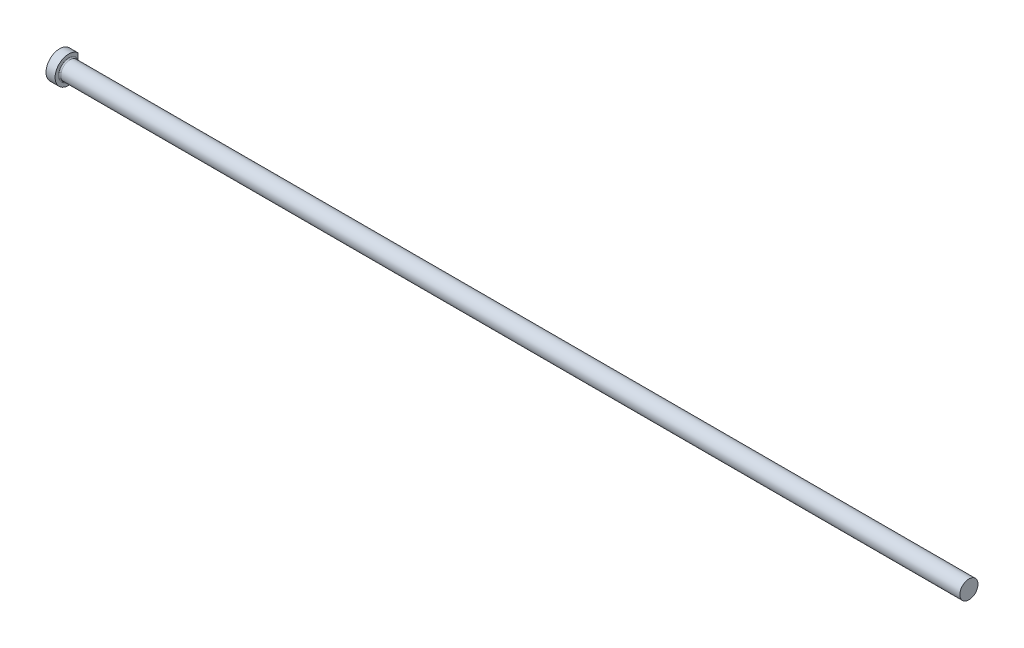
ISO-10303-21;
HEADER;
FILE_DESCRIPTION(('STEP AP214'),'2;1');
FILE_NAME('part.step','',(''),(''),'','','');
FILE_SCHEMA(('AUTOMOTIVE_DESIGN { 1 0 10303 214 1 1 1 1 }'));
ENDSEC;
DATA;
#1=APPLICATION_CONTEXT('core data for automotive mechanical design processes');
#2=APPLICATION_PROTOCOL_DEFINITION('international standard','automotive_design',2000,#1);
#3=PRODUCT_CONTEXT('',#1,'mechanical');
#4=PRODUCT('Part','Part','',(#3));
#5=PRODUCT_RELATED_PRODUCT_CATEGORY('part','',(#4));
#6=PRODUCT_DEFINITION_FORMATION('','',#4);
#7=PRODUCT_DEFINITION_CONTEXT('part definition',#1,'design');
#8=PRODUCT_DEFINITION('design','',#6,#7);
#9=PRODUCT_DEFINITION_SHAPE('','',#8);
#10=(LENGTH_UNIT() NAMED_UNIT(*) SI_UNIT(.MILLI.,.METRE.));
#11=(NAMED_UNIT(*) PLANE_ANGLE_UNIT() SI_UNIT($,.RADIAN.));
#12=(NAMED_UNIT(*) SI_UNIT($,.STERADIAN.) SOLID_ANGLE_UNIT());
#13=UNCERTAINTY_MEASURE_WITH_UNIT(LENGTH_MEASURE(1.E-05),#10,'distance_accuracy_value','');
#14=(GEOMETRIC_REPRESENTATION_CONTEXT(3) GLOBAL_UNCERTAINTY_ASSIGNED_CONTEXT((#13)) GLOBAL_UNIT_ASSIGNED_CONTEXT((#10,
#11,#12)) REPRESENTATION_CONTEXT('',''));
#15=CARTESIAN_POINT('',(0.,0.,0.));
#16=DIRECTION('',(0.,0.,1.));
#17=DIRECTION('',(1.,0.,0.));
#18=AXIS2_PLACEMENT_3D('',#15,#16,#17);
#19=CARTESIAN_POINT('',(0.,0.,0.));
#20=DIRECTION('',(1.,0.,0.));
#21=DIRECTION('',(0.,1.,0.));
#22=AXIS2_PLACEMENT_3D('',#19,#20,#21);
#23=PLANE('',#22);
#24=DIRECTION('',(0.,1.,0.));
#25=VECTOR('',#24,1.);
#26=CARTESIAN_POINT('',(0.,0.,-6.52779999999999));
#27=LINE('',#26,#25);
#28=CARTESIAN_POINT('',(0.,-6.93638610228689,-6.52779999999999));
#29=VERTEX_POINT('',#28);
#30=CARTESIAN_POINT('',(0.,6.93638610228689,-6.52779999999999));
#31=VERTEX_POINT('',#30);
#32=EDGE_CURVE('E49',#29,#31,#27,.T.);
#33=ORIENTED_EDGE('',*,*,#32,.F.);
#34=CARTESIAN_POINT('',(0.,0.,0.));
#35=DIRECTION('',(-1.,0.,0.));
#36=DIRECTION('',(0.,-1.,0.));
#37=AXIS2_PLACEMENT_3D('',#34,#35,#36);
#38=CIRCLE('',#37,9.52499999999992);
#39=EDGE_CURVE('E43',#29,#31,#38,.T.);
#40=ORIENTED_EDGE('',*,*,#39,.T.);
#41=EDGE_LOOP('',(#33,#40));
#42=FACE_BOUND('',#41,.T.);
#43=ADVANCED_FACE('F32',(#42),#23,.F.);
#44=CARTESIAN_POINT('',(635.,0.,0.));
#45=DIRECTION('',(-1.,0.,0.));
#46=DIRECTION('',(0.,-1.,0.));
#47=AXIS2_PLACEMENT_3D('',#44,#45,#46);
#48=CYLINDRICAL_SURFACE('',#47,9.52499999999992);
#49=DIRECTION('',(-1.,0.,0.));
#50=VECTOR('',#49,1.);
#51=CARTESIAN_POINT('',(635.,-6.93638610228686,-6.52779999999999));
#52=LINE('',#51,#50);
#53=CARTESIAN_POINT('',(6.34999999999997,-6.93638610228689,-6.52779999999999));
#54=VERTEX_POINT('',#53);
#55=EDGE_CURVE('E87',#54,#29,#52,.T.);
#56=ORIENTED_EDGE('',*,*,#55,.F.);
#57=CARTESIAN_POINT('',(6.34999999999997,0.,0.));
#58=DIRECTION('',(-1.,0.,0.));
#59=DIRECTION('',(0.,-1.,0.));
#60=AXIS2_PLACEMENT_3D('',#57,#58,#59);
#61=CIRCLE('',#60,9.52499999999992);
#62=CARTESIAN_POINT('',(6.34999999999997,6.93638610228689,-6.52779999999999));
#63=VERTEX_POINT('',#62);
#64=EDGE_CURVE('E75',#54,#63,#61,.T.);
#65=ORIENTED_EDGE('',*,*,#64,.T.);
#66=DIRECTION('',(-1.,0.,0.));
#67=VECTOR('',#66,1.);
#68=CARTESIAN_POINT('',(635.,6.93638610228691,-6.52779999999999));
#69=LINE('',#68,#67);
#70=EDGE_CURVE('E56',#31,#63,#69,.F.);
#71=ORIENTED_EDGE('',*,*,#70,.F.);
#72=ORIENTED_EDGE('',*,*,#39,.F.);
#73=EDGE_LOOP('',(#56,#65,#71,#72));
#74=FACE_BOUND('',#73,.T.);
#75=ADVANCED_FACE('F97',(#74),#48,.T.);
#76=CARTESIAN_POINT('',(6.35,9.52499999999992,0.));
#77=DIRECTION('',(-1.,0.,0.));
#78=DIRECTION('',(0.,-1.,0.));
#79=AXIS2_PLACEMENT_3D('',#76,#77,#78);
#80=PLANE('',#79);
#81=DIRECTION('',(0.,-1.,0.));
#82=VECTOR('',#81,1.);
#83=CARTESIAN_POINT('',(6.35,9.52499999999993,-6.52779999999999));
#84=LINE('',#83,#82);
#85=CARTESIAN_POINT('',(6.34999999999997,2.88622693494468,-6.52779999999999));
#86=VERTEX_POINT('',#85);
#87=EDGE_CURVE('E84',#63,#86,#84,.T.);
#88=ORIENTED_EDGE('',*,*,#87,.F.);
#89=ORIENTED_EDGE('',*,*,#64,.F.);
#90=CARTESIAN_POINT('',(6.35,-2.88622693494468,-6.52779999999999));
#91=VERTEX_POINT('',#90);
#92=EDGE_CURVE('E80',#91,#54,#84,.T.);
#93=ORIENTED_EDGE('',*,*,#92,.F.);
#94=CARTESIAN_POINT('',(6.34999999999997,0.,0.));
#95=DIRECTION('',(-1.,0.,0.));
#96=DIRECTION('',(0.,-1.,0.));
#97=AXIS2_PLACEMENT_3D('',#94,#95,#96);
#98=CIRCLE('',#97,7.1374);
#99=EDGE_CURVE('E70',#91,#86,#98,.T.);
#100=ORIENTED_EDGE('',*,*,#99,.T.);
#101=EDGE_LOOP('',(#88,#89,#93,#100));
#102=FACE_BOUND('',#101,.T.);
#103=ADVANCED_FACE('F81',(#102),#80,.F.);
#104=CARTESIAN_POINT('',(7.1374,0.,0.));
#105=DIRECTION('',(-1.,0.,0.));
#106=DIRECTION('',(0.,-1.,0.));
#107=AXIS2_PLACEMENT_3D('',#104,#105,#106);
#108=TOROIDAL_SURFACE('',#107,7.1374,0.7874);
#109=CARTESIAN_POINT('',(7.13739999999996,0.,0.));
#110=DIRECTION('',(-1.,0.,0.));
#111=DIRECTION('',(0.,-1.,0.));
#112=AXIS2_PLACEMENT_3D('',#109,#110,#111);
#113=CIRCLE('',#112,6.35);
#114=CARTESIAN_POINT('',(7.13739999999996,-6.35,0.));
#115=VERTEX_POINT('',#114);
#116=EDGE_CURVE('E76',#115,#115,#113,.T.);
#117=ORIENTED_EDGE('',*,*,#116,.T.);
#118=EDGE_LOOP('',(#117));
#119=FACE_BOUND('',#118,.T.);
#120=CARTESIAN_POINT('',(6.63901601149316,0.,-6.52779999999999));
#121=CARTESIAN_POINT('',(6.63901644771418,-0.0657930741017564,-6.52779999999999));
#122=CARTESIAN_POINT('',(6.63779028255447,-0.131585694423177,-6.52779999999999));
#123=CARTESIAN_POINT('',(6.63299087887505,-0.263087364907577,-6.52779999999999));
#124=CARTESIAN_POINT('',(6.6294174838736,-0.328796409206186,-6.52779999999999));
#125=CARTESIAN_POINT('',(6.61555674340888,-0.52576216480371,-6.52779999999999));
#126=CARTESIAN_POINT('',(6.60212925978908,-0.656794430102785,-6.52779999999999));
#127=CARTESIAN_POINT('',(6.57011296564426,-0.919062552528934,-6.52779999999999));
#128=CARTESIAN_POINT('',(6.55148997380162,-1.05029382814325,-6.52779999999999));
#129=CARTESIAN_POINT('',(6.5126303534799,-1.31258160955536,-6.52779999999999));
#130=CARTESIAN_POINT('',(6.4923928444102,-1.44363797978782,-6.52779999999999));
#131=CARTESIAN_POINT('',(6.45671462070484,-1.68300428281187,-6.52779999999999));
#132=CARTESIAN_POINT('',(6.44105431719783,-1.79128046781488,-6.52779999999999));
#133=CARTESIAN_POINT('',(6.4121649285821,-2.00818400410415,-6.52779999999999));
#134=CARTESIAN_POINT('',(6.39893618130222,-2.11681140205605,-6.52779999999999));
#135=CARTESIAN_POINT('',(6.37640984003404,-2.33430472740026,-6.52779999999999));
#136=CARTESIAN_POINT('',(6.36710572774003,-2.443169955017,-6.52779999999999));
#137=CARTESIAN_POINT('',(6.35397832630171,-2.66121869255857,-6.52779999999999));
#138=CARTESIAN_POINT('',(6.35015246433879,-2.77040202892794,-6.52779999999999));
#139=CARTESIAN_POINT('',(6.34991766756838,-2.94374292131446,-6.52779999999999));
#140=CARTESIAN_POINT('',(6.35110031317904,-3.00789610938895,-6.52779999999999));
#141=CARTESIAN_POINT('',(6.35647225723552,-3.13610972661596,-6.52779999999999));
#142=CARTESIAN_POINT('',(6.3606626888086,-3.20017011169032,-6.52779999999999));
#143=CARTESIAN_POINT('',(6.37259665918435,-3.32794004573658,-6.52779999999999));
#144=CARTESIAN_POINT('',(6.38033850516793,-3.39164974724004,-6.52779999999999));
#145=CARTESIAN_POINT('',(6.40004602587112,-3.51839481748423,-6.52779999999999));
#146=CARTESIAN_POINT('',(6.41200949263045,-3.58143052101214,-6.52779999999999));
#147=CARTESIAN_POINT('',(6.44333242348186,-3.71638651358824,-6.52779999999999));
#148=CARTESIAN_POINT('',(6.46357074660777,-3.78810901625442,-6.52779999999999));
#149=CARTESIAN_POINT('',(6.51261769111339,-3.92863037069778,-6.52779999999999));
#150=CARTESIAN_POINT('',(6.54141681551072,-3.99743236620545,-6.52779999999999));
#151=CARTESIAN_POINT('',(6.59871994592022,-4.1078028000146,-6.52779999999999));
#152=CARTESIAN_POINT('',(6.62423136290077,-4.15091044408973,-6.52779999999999));
#153=CARTESIAN_POINT('',(6.68110480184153,-4.23312392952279,-6.52779999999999));
#154=CARTESIAN_POINT('',(6.71245691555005,-4.2722363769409,-6.52779999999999));
#155=CARTESIAN_POINT('',(6.7709220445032,-4.33280276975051,-6.52779999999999));
#156=CARTESIAN_POINT('',(6.79627456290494,-4.35594498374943,-6.52779999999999));
#157=CARTESIAN_POINT('',(6.85023309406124,-4.39809153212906,-6.52779999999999));
#158=CARTESIAN_POINT('',(6.87883426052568,-4.41710191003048,-6.52779999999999));
#159=CARTESIAN_POINT('',(6.9330870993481,-4.4463787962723,-6.52779999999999));
#160=CARTESIAN_POINT('',(6.95820262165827,-4.45763114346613,-6.52779999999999));
#161=CARTESIAN_POINT('',(7.00995920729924,-4.47582045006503,-6.52779999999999));
#162=CARTESIAN_POINT('',(7.03659903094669,-4.4827608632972,-6.52779999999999));
#163=CARTESIAN_POINT('',(7.09085505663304,-4.4917690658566,-6.52779999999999));
#164=CARTESIAN_POINT('',(7.11847577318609,-4.49381020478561,-6.52779999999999));
#165=CARTESIAN_POINT('',(7.17361672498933,-4.49274192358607,-6.52779999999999));
#166=CARTESIAN_POINT('',(7.2011369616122,-4.489632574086,-6.52779999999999));
#167=CARTESIAN_POINT('',(7.25292339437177,-4.47902460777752,-6.52779999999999));
#168=CARTESIAN_POINT('',(7.27727050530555,-4.47191015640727,-6.52779999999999));
#169=CARTESIAN_POINT('',(7.32460612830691,-4.45410498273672,-6.52779999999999));
#170=CARTESIAN_POINT('',(7.34759413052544,-4.44341292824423,-6.52779999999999));
#171=CARTESIAN_POINT('',(7.40176610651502,-4.41362274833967,-6.52779999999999));
#172=CARTESIAN_POINT('',(7.43205576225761,-4.39290025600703,-6.52779999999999));
#173=CARTESIAN_POINT('',(7.48894558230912,-4.34689823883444,-6.52779999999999));
#174=CARTESIAN_POINT('',(7.51553684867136,-4.32160804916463,-6.52779999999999));
#175=CARTESIAN_POINT('',(7.57887879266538,-4.25296468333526,-6.52779999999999));
#176=CARTESIAN_POINT('',(7.61314947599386,-4.20733933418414,-6.52779999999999));
#177=CARTESIAN_POINT('',(7.67447290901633,-4.11151073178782,-6.52779999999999));
#178=CARTESIAN_POINT('',(7.70150829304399,-4.06129684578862,-6.52779999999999));
#179=CARTESIAN_POINT('',(7.74730597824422,-3.9629857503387,-6.52779999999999));
#180=CARTESIAN_POINT('',(7.7666075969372,-3.9151344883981,-6.52779999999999));
#181=CARTESIAN_POINT('',(7.80105869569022,-3.81793882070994,-6.52779999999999));
#182=CARTESIAN_POINT('',(7.81620462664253,-3.76859317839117,-6.52779999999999));
#183=CARTESIAN_POINT('',(7.84295827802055,-3.66892230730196,-6.52779999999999));
#184=CARTESIAN_POINT('',(7.85456297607,-3.61859628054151,-6.52779999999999));
#185=CARTESIAN_POINT('',(7.87471467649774,-3.51736621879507,-6.52779999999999));
#186=CARTESIAN_POINT('',(7.88326278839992,-3.46646240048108,-6.52779999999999));
#187=CARTESIAN_POINT('',(7.90067504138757,-3.34343462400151,-6.52779999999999));
#188=CARTESIAN_POINT('',(7.90824458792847,-3.27112827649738,-6.52779999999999));
#189=CARTESIAN_POINT('',(7.91908335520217,-3.12618302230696,-6.52779999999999));
#190=CARTESIAN_POINT('',(7.92235046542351,-3.05354396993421,-6.52779999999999));
#191=CARTESIAN_POINT('',(7.92683516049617,-2.83528850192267,-6.52779999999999));
#192=CARTESIAN_POINT('',(7.92270858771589,-2.68956605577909,-6.52779999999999));
#193=CARTESIAN_POINT('',(7.90475897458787,-2.39759555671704,-6.52779999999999));
#194=CARTESIAN_POINT('',(7.89085302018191,-2.25135372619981,-6.52779999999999));
#195=CARTESIAN_POINT('',(7.85700674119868,-1.95973428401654,-6.52779999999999));
#196=CARTESIAN_POINT('',(7.83707165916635,-1.8143560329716,-6.52779999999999));
#197=CARTESIAN_POINT('',(7.79223464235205,-1.50712650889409,-6.52779999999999));
#198=CARTESIAN_POINT('',(7.76702473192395,-1.34532401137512,-6.52779999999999));
#199=CARTESIAN_POINT('',(7.7190043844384,-1.0212594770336,-6.52779999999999));
#200=CARTESIAN_POINT('',(7.69619470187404,-0.858997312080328,-6.52779999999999));
#201=CARTESIAN_POINT('',(7.66886659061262,-0.615678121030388,-6.52779999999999));
#202=CARTESIAN_POINT('',(7.66092984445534,-0.535023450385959,-6.52779999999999));
#203=CARTESIAN_POINT('',(7.64805328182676,-0.37348038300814,-6.52779999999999));
#204=CARTESIAN_POINT('',(7.64311299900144,-0.292592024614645,-6.52779999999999));
#205=CARTESIAN_POINT('',(7.63678993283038,-0.130758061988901,-6.52779999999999));
#206=CARTESIAN_POINT('',(7.63540330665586,-0.0498126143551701,-6.52779999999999));
#207=CARTESIAN_POINT('',(7.63634612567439,0.112055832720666,-6.52779999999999));
#208=CARTESIAN_POINT('',(7.63867559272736,0.192978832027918,-6.52779999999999));
#209=CARTESIAN_POINT('',(7.64723816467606,0.363961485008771,-6.52779999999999));
#210=CARTESIAN_POINT('',(7.65389014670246,0.453999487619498,-6.52779999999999));
#211=CARTESIAN_POINT('',(7.67057840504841,0.633758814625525,-6.52779999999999));
#212=CARTESIAN_POINT('',(7.68061512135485,0.723480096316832,-6.52779999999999));
#213=CARTESIAN_POINT('',(7.70296726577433,0.902797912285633,-6.52779999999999));
#214=CARTESIAN_POINT('',(7.71528688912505,0.992393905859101,-6.52779999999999));
#215=CARTESIAN_POINT('',(7.74108017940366,1.17141282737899,-6.52779999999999));
#216=CARTESIAN_POINT('',(7.7545538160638,1.26083575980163,-6.52779999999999));
#217=CARTESIAN_POINT('',(7.79540879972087,1.53076625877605,-6.52779999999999));
#218=CARTESIAN_POINT('',(7.82297275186,1.71124349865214,-6.52779999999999));
#219=CARTESIAN_POINT('',(7.87137102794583,2.07295737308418,-6.52779999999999));
#220=CARTESIAN_POINT('',(7.89221479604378,2.25419257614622,-6.52779999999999));
#221=CARTESIAN_POINT('',(7.91330544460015,2.52729761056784,-6.52779999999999));
#222=CARTESIAN_POINT('',(7.91864029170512,2.61875609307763,-6.52779999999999));
#223=CARTESIAN_POINT('',(7.92484591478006,2.80181357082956,-6.52779999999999));
#224=CARTESIAN_POINT('',(7.92571813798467,2.89341251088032,-6.52779999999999));
#225=CARTESIAN_POINT('',(7.9218085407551,3.07601526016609,-6.52779999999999));
#226=CARTESIAN_POINT('',(7.91705732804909,3.16701960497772,-6.52779999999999));
#227=CARTESIAN_POINT('',(7.90046196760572,3.34834402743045,-6.52779999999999));
#228=CARTESIAN_POINT('',(7.88862552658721,3.4386647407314,-6.52779999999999));
#229=CARTESIAN_POINT('',(7.86136065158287,3.58761682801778,-6.52779999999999));
#230=CARTESIAN_POINT('',(7.84847177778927,3.64670810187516,-6.52779999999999));
#231=CARTESIAN_POINT('',(7.81783228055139,3.76385836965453,-6.52779999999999));
#232=CARTESIAN_POINT('',(7.80006538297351,3.82191320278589,-6.52779999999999));
#233=CARTESIAN_POINT('',(7.75342880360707,3.95051789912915,-6.52779999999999));
#234=CARTESIAN_POINT('',(7.72288303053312,4.0204775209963,-6.52779999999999));
#235=CARTESIAN_POINT('',(7.65003295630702,4.15396303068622,-6.52779999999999));
#236=CARTESIAN_POINT('',(7.60779892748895,4.21752436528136,-6.52779999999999));
#237=CARTESIAN_POINT('',(7.53647698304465,4.29981474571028,-6.52779999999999));
#238=CARTESIAN_POINT('',(7.51332552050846,4.32367553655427,-6.52779999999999));
#239=CARTESIAN_POINT('',(7.46396465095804,4.36807267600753,-6.52779999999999));
#240=CARTESIAN_POINT('',(7.43775463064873,4.38860835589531,-6.52779999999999));
#241=CARTESIAN_POINT('',(7.38196767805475,4.42540217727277,-6.52779999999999));
#242=CARTESIAN_POINT('',(7.35235368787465,4.44160528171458,-6.52779999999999));
#243=CARTESIAN_POINT('',(7.29053705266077,4.46795310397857,-6.52779999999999));
#244=CARTESIAN_POINT('',(7.25833959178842,4.4781096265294,-6.52779999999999));
#245=CARTESIAN_POINT('',(7.19644050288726,4.49040772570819,-6.52779999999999));
#246=CARTESIAN_POINT('',(7.16690212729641,4.49336389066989,-6.52779999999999));
#247=CARTESIAN_POINT('',(7.10782823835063,4.49335569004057,-6.52779999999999));
#248=CARTESIAN_POINT('',(7.07829272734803,4.49039330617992,-6.52779999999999));
#249=CARTESIAN_POINT('',(7.02448918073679,4.47970576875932,-6.52779999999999));
#250=CARTESIAN_POINT('',(7.00006897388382,4.47271712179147,-6.52779999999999));
#251=CARTESIAN_POINT('',(6.95257735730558,4.45513534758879,-6.52779999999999));
#252=CARTESIAN_POINT('',(6.92950628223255,4.44454133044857,-6.52779999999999));
#253=CARTESIAN_POINT('',(6.87533060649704,4.41506598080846,-6.52779999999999));
#254=CARTESIAN_POINT('',(6.84509808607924,4.39458439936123,-6.52779999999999));
#255=CARTESIAN_POINT('',(6.78828531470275,4.34906654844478,-6.52779999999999));
#256=CARTESIAN_POINT('',(6.76171390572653,4.32401958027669,-6.52779999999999));
#257=CARTESIAN_POINT('',(6.69847203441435,4.25607843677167,-6.52779999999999));
#258=CARTESIAN_POINT('',(6.66424587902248,4.21092523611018,-6.52779999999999));
#259=CARTESIAN_POINT('',(6.60294985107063,4.11604206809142,-6.52779999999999));
#260=CARTESIAN_POINT('',(6.57589652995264,4.06630186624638,-6.52779999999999));
#261=CARTESIAN_POINT('',(6.53006910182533,3.96898574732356,-6.52779999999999));
#262=CARTESIAN_POINT('',(6.51074907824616,3.92166150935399,-6.52779999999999));
#263=CARTESIAN_POINT('',(6.47621700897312,3.82551648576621,-6.52779999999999));
#264=CARTESIAN_POINT('',(6.46100844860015,3.77669446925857,-6.52779999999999));
#265=CARTESIAN_POINT('',(6.43409062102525,3.6780471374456,-6.52779999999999));
#266=CARTESIAN_POINT('',(6.42238559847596,3.62822068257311,-6.52779999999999));
#267=CARTESIAN_POINT('',(6.4020085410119,3.52798105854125,-6.52779999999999));
#268=CARTESIAN_POINT('',(6.39333543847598,3.47756810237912,-6.52779999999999));
#269=CARTESIAN_POINT('',(6.37568471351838,3.35629905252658,-6.52779999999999));
#270=CARTESIAN_POINT('',(6.36794990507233,3.28526290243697,-6.52779999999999));
#271=CARTESIAN_POINT('',(6.35669152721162,3.14284702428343,-6.52779999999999));
#272=CARTESIAN_POINT('',(6.35316998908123,3.07146714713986,-6.52779999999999));
#273=CARTESIAN_POINT('',(6.34782697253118,2.85697626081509,-6.52779999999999));
#274=CARTESIAN_POINT('',(6.35125457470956,2.7137376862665,-6.52779999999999));
#275=CARTESIAN_POINT('',(6.36770054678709,2.4268690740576,-6.52779999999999));
#276=CARTESIAN_POINT('',(6.38079014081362,2.28324406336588,-6.52779999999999));
#277=CARTESIAN_POINT('',(6.4130588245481,1.99684822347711,-6.52779999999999));
#278=CARTESIAN_POINT('',(6.43223239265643,1.85407673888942,-6.52779999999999));
#279=CARTESIAN_POINT('',(6.47335763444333,1.56869278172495,-6.52779999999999));
#280=CARTESIAN_POINT('',(6.49531432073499,1.42608107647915,-6.52779999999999));
#281=CARTESIAN_POINT('',(6.53832277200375,1.1406462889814,-6.52779999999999));
#282=CARTESIAN_POINT('',(6.55937409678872,0.997823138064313,-6.52779999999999));
#283=CARTESIAN_POINT('',(6.59596084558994,0.712816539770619,-6.52779999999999));
#284=CARTESIAN_POINT('',(6.6115482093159,0.570640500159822,-6.52779999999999));
#285=CARTESIAN_POINT('',(6.62773323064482,0.356875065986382,-6.52779999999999));
#286=CARTESIAN_POINT('',(6.63192865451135,0.285565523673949,-6.52779999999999));
#287=CARTESIAN_POINT('',(6.63756975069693,0.142837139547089,-6.52779999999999));
#288=CARTESIAN_POINT('',(6.63901553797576,0.0714183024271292,-6.52779999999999));
#289=CARTESIAN_POINT('',(6.63901601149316,0.,-6.52779999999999));
#290=B_SPLINE_CURVE_WITH_KNOTS('',3,(#120,#121,#122,#123,#124,#125,#126,#127,#128,#129,#130,
#131,#132,#133,#134,#135,#136,#137,#138,#139,#140,#141,#142,#143,#144,#145,#146,#147,#148,#149,
#150,#151,#152,#153,#154,#155,#156,#157,#158,#159,#160,#161,#162,#163,#164,#165,#166,#167,#168,
#169,#170,#171,#172,#173,#174,#175,#176,#177,#178,#179,#180,#181,#182,#183,#184,#185,#186,#187,
#188,#189,#190,#191,#192,#193,#194,#195,#196,#197,#198,#199,#200,#201,#202,#203,#204,#205,#206,
#207,#208,#209,#210,#211,#212,#213,#214,#215,#216,#217,#218,#219,#220,#221,#222,#223,#224,#225,
#226,#227,#228,#229,#230,#231,#232,#233,#234,#235,#236,#237,#238,#239,#240,#241,#242,#243,#244,
#245,#246,#247,#248,#249,#250,#251,#252,#253,#254,#255,#256,#257,#258,#259,#260,#261,#262,#263,
#264,#265,#266,#267,#268,#269,#270,#271,#272,#273,#274,#275,#276,#277,#278,#279,#280,#281,#282,
#283,#284,#285,#286,#287,#288,#289),.UNSPECIFIED.,.T.,.F.,(4,2,2,2,2,2,2,2,2,2,2,2,2,2,2,2,2,2,
2,2,2,2,2,2,2,2,2,2,2,2,2,2,2,2,2,2,2,2,2,2,2,2,2,2,2,2,2,2,2,2,2,2,2,2,2,2,2,2,2,2,2,2,2,2,2,2,
2,2,2,2,2,2,2,2,2,2,2,2,2,2,2,2,2,2,4),(0.,0.19736763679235,0.394748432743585,0.789698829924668,
1.18731150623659,1.58514255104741,1.91333986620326,2.24158274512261,2.56927828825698,
2.89681988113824,3.08925583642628,3.281764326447,3.47418115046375,3.66649748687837,
3.8896796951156,4.11261523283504,4.26253512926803,4.41220297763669,4.51487143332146,
4.61738869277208,4.69962137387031,4.78178810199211,4.86440078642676,4.94701233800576,
5.02279347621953,5.09860286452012,5.20808133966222,5.31781881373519,5.48804853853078,
5.65868324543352,5.81324977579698,5.96794790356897,6.12277769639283,6.27755122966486,
6.49548587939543,6.71352739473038,7.15030868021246,7.59083855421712,8.0309864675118,
8.5222790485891,9.01372560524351,9.25681320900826,9.4998629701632,9.74264979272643,
9.98543804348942,10.256202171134,10.5270015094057,10.7983035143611,11.0695984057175,
11.6173198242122,12.1642681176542,12.4390268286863,12.7136964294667,12.9868778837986,
13.2597627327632,13.4410442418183,13.622938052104,13.8512302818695,14.0781787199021,
14.17768001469,14.277201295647,14.3779324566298,14.4784663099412,14.5669532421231,
14.6554105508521,14.7312996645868,14.8072075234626,14.9161418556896,15.0253348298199,
15.1943603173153,15.3637725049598,15.5168971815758,15.6701512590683,15.8235902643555,
15.9769751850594,16.1911781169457,16.4054842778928,16.8347693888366,17.26725101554,
17.6993412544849,18.132221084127,18.5653090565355,18.9941607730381,19.2084120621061,
19.4226543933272),.UNSPECIFIED.);
#291=EDGE_CURVE('E12',#86,#91,#290,.T.);
#292=ORIENTED_EDGE('',*,*,#291,.F.);
#293=ORIENTED_EDGE('',*,*,#99,.F.);
#294=EDGE_LOOP('',(#292,#293));
#295=FACE_BOUND('',#294,.T.);
#296=ADVANCED_FACE('F72',(#119,#295),#108,.F.);
#297=CARTESIAN_POINT('',(635.,0.,0.));
#298=DIRECTION('',(-1.,0.,0.));
#299=DIRECTION('',(0.,-1.,0.));
#300=AXIS2_PLACEMENT_3D('',#297,#298,#299);
#301=CYLINDRICAL_SURFACE('',#300,6.34999999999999);
#302=ORIENTED_EDGE('',*,*,#116,.F.);
#303=EDGE_LOOP('',(#302));
#304=FACE_BOUND('',#303,.T.);
#305=CARTESIAN_POINT('',(635.,0.,0.));
#306=DIRECTION('',(-1.,0.,0.));
#307=DIRECTION('',(0.,-1.,0.));
#308=AXIS2_PLACEMENT_3D('',#305,#306,#307);
#309=CIRCLE('',#308,6.34999999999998);
#310=CARTESIAN_POINT('',(635.,-6.34999999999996,0.));
#311=VERTEX_POINT('',#310);
#312=EDGE_CURVE('E92',#311,#311,#309,.T.);
#313=ORIENTED_EDGE('',*,*,#312,.T.);
#314=EDGE_LOOP('',(#313));
#315=FACE_BOUND('',#314,.T.);
#316=ADVANCED_FACE('F107',(#304,#315),#301,.T.);
#317=CARTESIAN_POINT('',(635.,6.35,0.));
#318=DIRECTION('',(-1.,0.,0.));
#319=DIRECTION('',(0.,-1.,0.));
#320=AXIS2_PLACEMENT_3D('',#317,#318,#319);
#321=PLANE('',#320);
#322=ORIENTED_EDGE('',*,*,#312,.F.);
#323=EDGE_LOOP('',(#322));
#324=FACE_BOUND('',#323,.T.);
#325=ADVANCED_FACE('F111',(#324),#321,.F.);
#326=CARTESIAN_POINT('',(0.,0.,-6.52779999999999));
#327=DIRECTION('',(0.,0.,-1.));
#328=DIRECTION('',(0.,1.,0.));
#329=AXIS2_PLACEMENT_3D('',#326,#327,#328);
#330=PLANE('',#329);
#331=ORIENTED_EDGE('',*,*,#55,.T.);
#332=ORIENTED_EDGE('',*,*,#32,.T.);
#333=ORIENTED_EDGE('',*,*,#70,.T.);
#334=ORIENTED_EDGE('',*,*,#87,.T.);
#335=ORIENTED_EDGE('',*,*,#291,.T.);
#336=ORIENTED_EDGE('',*,*,#92,.T.);
#337=EDGE_LOOP('',(#331,#332,#333,#334,#335,#336));
#338=FACE_BOUND('',#337,.T.);
#339=ADVANCED_FACE('F86',(#338),#330,.T.);
#340=CLOSED_SHELL('',(#43,#75,#103,#296,#316,#325,#339));
#341=MANIFOLD_SOLID_BREP('B2',#340);
#342=ADVANCED_BREP_SHAPE_REPRESENTATION('',(#18,#341),#14);
#343=SHAPE_DEFINITION_REPRESENTATION(#9,#342);
ENDSEC;
END-ISO-10303-21;
